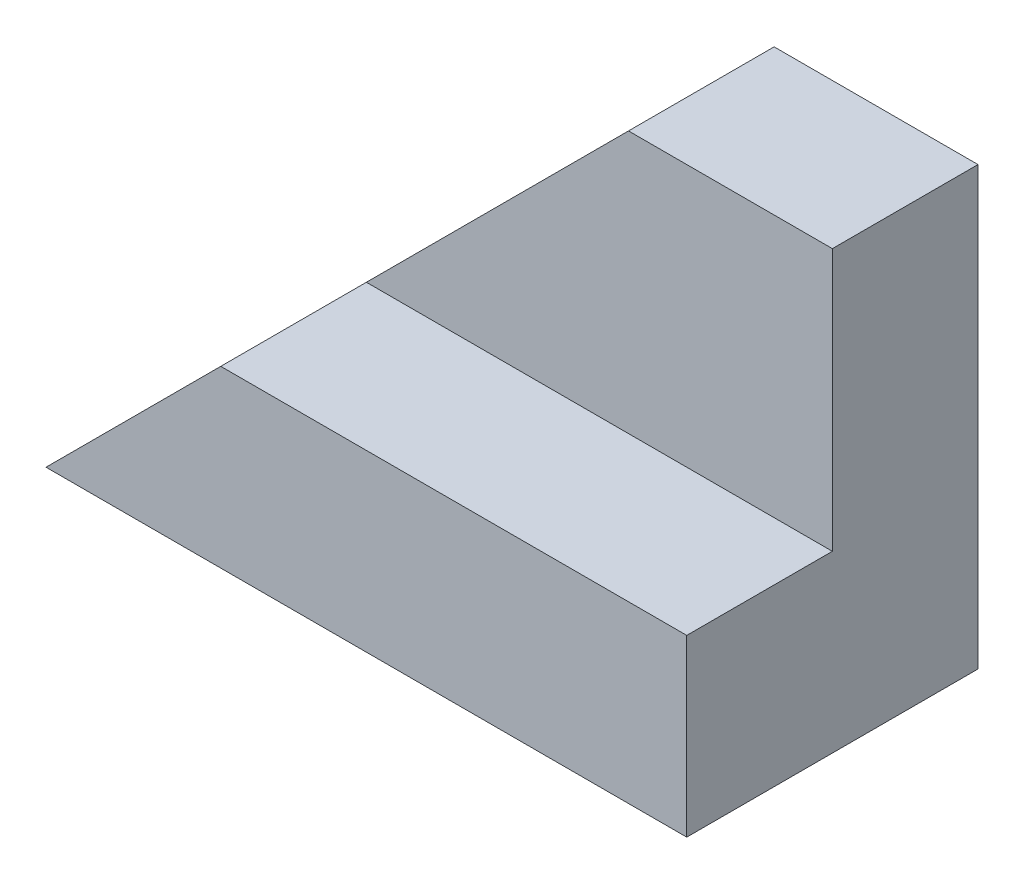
from build123d import *

# Parameters (mm, degrees)
EXTRUDE_1_DEPTH     = 50
CUT_EXTRUDE_1_DEPTH = 25


with BuildPart() as part:
    # Sketch 1 → Extrude 1 (new body)
    with BuildSketch(Plane.XY):
        Polygon((0, 0), (110, 0), (110, 75), (75, 75), align=None)
    extrude(amount=EXTRUDE_1_DEPTH)

    # Sketch 2 → Cut-Extrude 1 (cut)
    with BuildSketch(Plane.XY.offset(50)):
        Polygon((75, 75), (110, 75), (110, 30), (30, 30), align=None)
    extrude(amount=-CUT_EXTRUDE_1_DEPTH, mode=Mode.SUBTRACT)


solid = part.part
